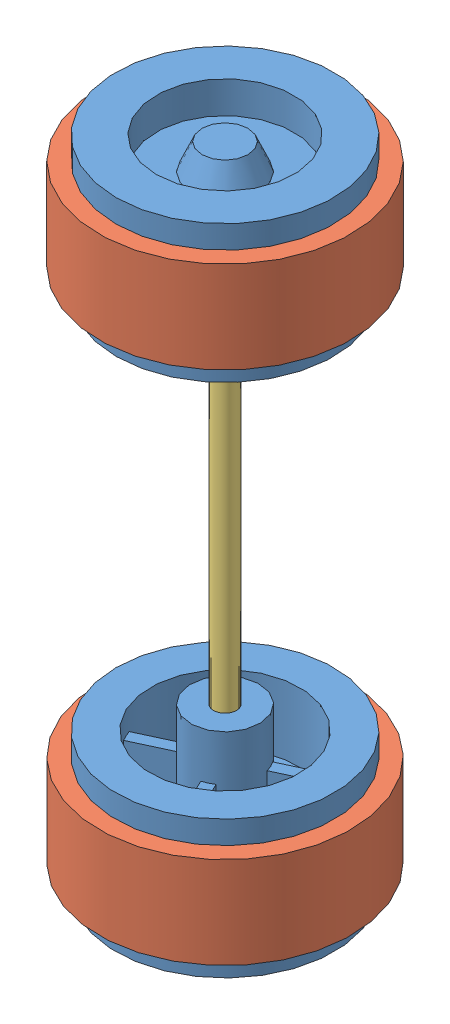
SolidWorks assembly essieu AR.SLDASM, configuration Default (file format 14000). Lengths in mm.
Overall size (32.21 57 32.21).
7 component instances, 3 part files, 4 mates.
Components (placement in the parent):
- roue-1: roue.SLDASM [Default] at (-7.1359 3.4656 1.411) size (30.45 14 30.45)
  - jante-1: jante.SLDPRT [Défaut] at origin size (19 14 19)
  - pneu-1: pneu.SLDPRT [Défaut] at (0 54 0) x (-0.837169 0 -0.546944) z (-0.546944 0 0.837169) size (22 8 22)
- axe essieu arriere-1: axe essieu arriere.SLDPRT [Default] at (17.9566 63.2556 1.411) size (2 39 2)
- roue-2: roue.SLDASM [Default] at (-7.1359 -25.5344 1.411) x (-0.421028 0 -0.907048) z (-0.907048 0 0.421028) size (30.45 14 30.45)
  - jante-1: jante.SLDPRT [Défaut] at origin size (19 14 19)
  - pneu-1: pneu.SLDPRT [Défaut] at (0 54 0) x (-0.837169 0 -0.546944) z (-0.546944 0 0.837169) size (22 8 22)
Mates (geometry in assembly coordinates):
- Coaxiale1: concentric aligned: cylinder of roue-1/jante-1 through (-7.1359 8.9656 1.411) axis (0 -1 0) radius 1; cylinder of axe essieu arriere-1 through (-7.1359 8.4656 1.411) axis (0 -1 0) radius 1
- Coaxiale2: concentric anti-aligned: cylinder of axe essieu arriere-1 through (-7.1359 8.4656 1.411) axis (0 -1 0) radius 1; cylinder of roue-2/jante-1 through (-7.1359 -31.0344 1.411) axis (0 1 0) radius 1
- Coïncidente1: coincident anti-aligned: plane of roue-1/jante-1 through (-7.1359 3.4656 1.411) normal (0 -1 0); plane of axe essieu arriere-1 through (-7.8659 3.4656 1.411) normal (0 1 0)
- Coïncidente2: coincident anti-aligned: plane of axe essieu arriere-1 through (-8.1359 -25.5344 1.411) normal (0 -1 0); plane of roue-2/jante-1 through (-7.1359 -25.5344 1.411) normal (0 1 0)
